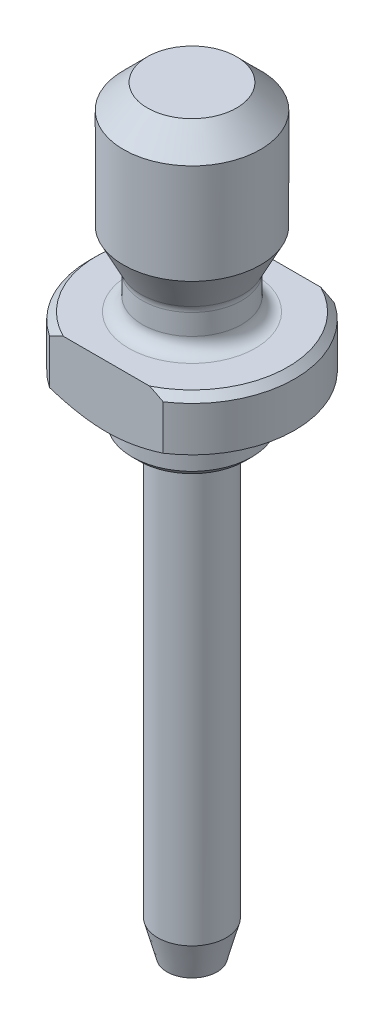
ISO-10303-21;
HEADER;
FILE_DESCRIPTION(('STEP AP214'),'2;1');
FILE_NAME('part.step','',(''),(''),'','','');
FILE_SCHEMA(('AUTOMOTIVE_DESIGN { 1 0 10303 214 1 1 1 1 }'));
ENDSEC;
DATA;
#1=APPLICATION_CONTEXT('core data for automotive mechanical design processes');
#2=APPLICATION_PROTOCOL_DEFINITION('international standard','automotive_design',2000,#1);
#3=PRODUCT_CONTEXT('',#1,'mechanical');
#4=PRODUCT('Part','Part','',(#3));
#5=PRODUCT_RELATED_PRODUCT_CATEGORY('part','',(#4));
#6=PRODUCT_DEFINITION_FORMATION('','',#4);
#7=PRODUCT_DEFINITION_CONTEXT('part definition',#1,'design');
#8=PRODUCT_DEFINITION('design','',#6,#7);
#9=PRODUCT_DEFINITION_SHAPE('','',#8);
#10=(LENGTH_UNIT() NAMED_UNIT(*) SI_UNIT(.MILLI.,.METRE.));
#11=(NAMED_UNIT(*) PLANE_ANGLE_UNIT() SI_UNIT($,.RADIAN.));
#12=(NAMED_UNIT(*) SI_UNIT($,.STERADIAN.) SOLID_ANGLE_UNIT());
#13=UNCERTAINTY_MEASURE_WITH_UNIT(LENGTH_MEASURE(1.E-05),#10,'distance_accuracy_value','');
#14=(GEOMETRIC_REPRESENTATION_CONTEXT(3) GLOBAL_UNCERTAINTY_ASSIGNED_CONTEXT((#13)) GLOBAL_UNIT_ASSIGNED_CONTEXT((#10,
#11,#12)) REPRESENTATION_CONTEXT('',''));
#15=CARTESIAN_POINT('',(0.,0.,0.));
#16=DIRECTION('',(0.,0.,1.));
#17=DIRECTION('',(1.,0.,0.));
#18=AXIS2_PLACEMENT_3D('',#15,#16,#17);
#19=CARTESIAN_POINT('',(0.,0.,0.));
#20=DIRECTION('',(0.,-1.,0.));
#21=DIRECTION('',(0.,0.,-1.));
#22=AXIS2_PLACEMENT_3D('',#19,#20,#21);
#23=CYLINDRICAL_SURFACE('',#22,3.);
#24=DIRECTION('',(0.,-1.,0.));
#25=VECTOR('',#24,1.);
#26=CARTESIAN_POINT('',(-1.6583123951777,0.,-2.5));
#27=LINE('',#26,#25);
#28=CARTESIAN_POINT('',(-1.6583123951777,-1.5,-2.5));
#29=VERTEX_POINT('',#28);
#30=CARTESIAN_POINT('',(-1.6583123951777,-0.2,-2.5));
#31=VERTEX_POINT('',#30);
#32=EDGE_CURVE('E195',#29,#31,#27,.F.);
#33=ORIENTED_EDGE('',*,*,#32,.F.);
#34=CARTESIAN_POINT('',(0.,-1.5,0.));
#35=DIRECTION('',(0.,1.,0.));
#36=DIRECTION('',(0.,0.,1.));
#37=AXIS2_PLACEMENT_3D('',#34,#35,#36);
#38=CIRCLE('',#37,3.);
#39=CARTESIAN_POINT('',(-1.6583123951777,-1.5,2.5));
#40=VERTEX_POINT('',#39);
#41=EDGE_CURVE('E289',#29,#40,#38,.T.);
#42=ORIENTED_EDGE('',*,*,#41,.T.);
#43=DIRECTION('',(0.,-1.,0.));
#44=VECTOR('',#43,1.);
#45=CARTESIAN_POINT('',(-1.6583123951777,0.,2.5));
#46=LINE('',#45,#44);
#47=CARTESIAN_POINT('',(-1.6583123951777,-0.2,2.5));
#48=VERTEX_POINT('',#47);
#49=EDGE_CURVE('E33',#48,#40,#46,.T.);
#50=ORIENTED_EDGE('',*,*,#49,.F.);
#51=CARTESIAN_POINT('',(0.,-0.2,0.));
#52=DIRECTION('',(0.,1.,0.));
#53=DIRECTION('',(0.,0.,1.));
#54=AXIS2_PLACEMENT_3D('',#51,#52,#53);
#55=CIRCLE('',#54,3.);
#56=EDGE_CURVE('E202',#48,#31,#55,.F.);
#57=ORIENTED_EDGE('',*,*,#56,.T.);
#58=EDGE_LOOP('',(#33,#42,#50,#57));
#59=FACE_BOUND('',#58,.T.);
#60=ADVANCED_FACE('F16',(#59),#23,.T.);
#61=CARTESIAN_POINT('',(0.,-0.2,0.));
#62=DIRECTION('',(0.,-1.,0.));
#63=DIRECTION('',(0.,0.,-1.));
#64=AXIS2_PLACEMENT_3D('',#61,#62,#63);
#65=CONICAL_SURFACE('',#64,3.,0.78539816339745);
#66=CARTESIAN_POINT('',(-1.65957840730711,-0.2007,-2.5));
#67=CARTESIAN_POINT('',(-1.57064275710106,-0.151563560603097,-2.5));
#68=CARTESIAN_POINT('',(-1.48050850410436,-0.104409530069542,-2.5));
#69=CARTESIAN_POINT('',(-1.29723653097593,-0.0153690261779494,-2.5));
#70=CARTESIAN_POINT('',(-1.20408808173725,0.026495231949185,-2.5));
#71=CARTESIAN_POINT('',(-1.01401910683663,0.103587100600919,-2.5));
#72=CARTESIAN_POINT('',(-0.917071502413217,0.138749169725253,-2.5));
#73=CARTESIAN_POINT('',(-0.720432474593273,0.199937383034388,-2.5));
#74=CARTESIAN_POINT('',(-0.62074566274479,0.22597797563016,-2.5));
#75=CARTESIAN_POINT('',(-0.446356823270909,0.261488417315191,-2.5));
#76=CARTESIAN_POINT('',(-0.372179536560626,0.273534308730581,-2.5));
#77=CARTESIAN_POINT('',(-0.223041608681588,0.291161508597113,-2.5));
#78=CARTESIAN_POINT('',(-0.148080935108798,0.296742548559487,-2.5));
#79=CARTESIAN_POINT('',(0.00156995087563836,0.301111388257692,-2.5));
#80=CARTESIAN_POINT('',(0.0762589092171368,0.299941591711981,-2.5));
#81=CARTESIAN_POINT('',(0.225233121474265,0.290976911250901,-2.5));
#82=CARTESIAN_POINT('',(0.299518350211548,0.283181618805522,-2.5));
#83=CARTESIAN_POINT('',(0.46561705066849,0.258646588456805,-2.5));
#84=CARTESIAN_POINT('',(0.55717231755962,0.240158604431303,-2.5));
#85=CARTESIAN_POINT('',(0.738174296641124,0.194773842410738,-2.5));
#86=CARTESIAN_POINT('',(0.827619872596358,0.167872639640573,-2.5));
#87=CARTESIAN_POINT('',(1.0045589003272,0.107009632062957,-2.5));
#88=CARTESIAN_POINT('',(1.0920397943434,0.0730118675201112,-2.5));
#89=CARTESIAN_POINT('',(1.26457685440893,-0.000546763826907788,-2.5));
#90=CARTESIAN_POINT('',(1.34963367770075,-0.0401061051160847,-2.5));
#91=CARTESIAN_POINT('',(1.47177892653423,-0.100868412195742,-2.5));
#92=CARTESIAN_POINT('',(1.50974987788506,-0.120327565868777,-2.5));
#93=CARTESIAN_POINT('',(1.58507226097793,-0.159972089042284,-2.5));
#94=CARTESIAN_POINT('',(1.62242582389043,-0.180153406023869,-2.5));
#95=CARTESIAN_POINT('',(1.65957840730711,-0.200699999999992,-2.5));
#96=B_SPLINE_CURVE_WITH_KNOTS('',3,(#66,#67,#68,#69,#70,#71,#72,#73,#74,#75,#76,#77,#78,#79,#80,
#81,#82,#83,#84,#85,#86,#87,#88,#89,#90,#91,#92,#93,#94,#95),.UNSPECIFIED.,.F.,.F.,(4,2,2,2,2,2,
2,2,2,2,2,2,2,2,4),(0.,0.304931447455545,0.611103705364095,0.920131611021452,1.22866777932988,
1.45386214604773,1.67906586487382,1.9028565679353,2.12666107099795,2.40638746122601,
2.68626121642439,2.96758916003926,3.24884008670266,3.37683284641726,3.50419469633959),.UNSPECIFIED.);
#97=CARTESIAN_POINT('',(-1.26095202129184,0.,-2.5));
#98=VERTEX_POINT('',#97);
#99=EDGE_CURVE('E293',#31,#98,#96,.T.);
#100=ORIENTED_EDGE('',*,*,#99,.F.);
#101=ORIENTED_EDGE('',*,*,#56,.F.);
#102=CARTESIAN_POINT('',(1.65957840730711,-0.2007,2.5));
#103=CARTESIAN_POINT('',(1.57064275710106,-0.151563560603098,2.5));
#104=CARTESIAN_POINT('',(1.48050850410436,-0.104409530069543,2.5));
#105=CARTESIAN_POINT('',(1.29723653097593,-0.0153690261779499,2.5));
#106=CARTESIAN_POINT('',(1.20408808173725,0.0264952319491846,2.5));
#107=CARTESIAN_POINT('',(1.01401910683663,0.103587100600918,2.5));
#108=CARTESIAN_POINT('',(0.917071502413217,0.138749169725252,2.5));
#109=CARTESIAN_POINT('',(0.720432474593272,0.199937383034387,2.5));
#110=CARTESIAN_POINT('',(0.62074566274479,0.225977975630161,2.5));
#111=CARTESIAN_POINT('',(0.446356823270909,0.261488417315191,2.5));
#112=CARTESIAN_POINT('',(0.372179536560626,0.27353430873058,2.5));
#113=CARTESIAN_POINT('',(0.223041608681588,0.291161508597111,2.5));
#114=CARTESIAN_POINT('',(0.148080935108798,0.296742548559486,2.5));
#115=CARTESIAN_POINT('',(-0.00156995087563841,0.301111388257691,2.5));
#116=CARTESIAN_POINT('',(-0.0762589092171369,0.29994159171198,2.5));
#117=CARTESIAN_POINT('',(-0.225233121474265,0.2909769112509,2.5));
#118=CARTESIAN_POINT('',(-0.299518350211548,0.283181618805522,2.5));
#119=CARTESIAN_POINT('',(-0.46561705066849,0.258646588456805,2.5));
#120=CARTESIAN_POINT('',(-0.55717231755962,0.240158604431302,2.5));
#121=CARTESIAN_POINT('',(-0.738174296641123,0.194773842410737,2.5));
#122=CARTESIAN_POINT('',(-0.827619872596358,0.167872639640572,2.5));
#123=CARTESIAN_POINT('',(-1.0045589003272,0.107009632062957,2.5));
#124=CARTESIAN_POINT('',(-1.0920397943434,0.0730118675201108,2.5));
#125=CARTESIAN_POINT('',(-1.26457685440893,-0.000546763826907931,2.5));
#126=CARTESIAN_POINT('',(-1.34963367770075,-0.0401061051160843,2.5));
#127=CARTESIAN_POINT('',(-1.47177892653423,-0.100868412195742,2.5));
#128=CARTESIAN_POINT('',(-1.50974987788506,-0.120327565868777,2.5));
#129=CARTESIAN_POINT('',(-1.58507226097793,-0.159972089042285,2.5));
#130=CARTESIAN_POINT('',(-1.62242582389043,-0.18015340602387,2.5));
#131=CARTESIAN_POINT('',(-1.65957840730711,-0.200699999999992,2.5));
#132=B_SPLINE_CURVE_WITH_KNOTS('',3,(#102,#103,#104,#105,#106,#107,#108,#109,#110,#111,#112,
#113,#114,#115,#116,#117,#118,#119,#120,#121,#122,#123,#124,#125,#126,#127,#128,#129,#130,#131),
.UNSPECIFIED.,.F.,.F.,(4,2,2,2,2,2,2,2,2,2,2,2,2,2,4),(0.,0.304931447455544,0.611103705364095,
0.920131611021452,1.22866777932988,1.45386214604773,1.67906586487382,1.9028565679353,
2.12666107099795,2.40638746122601,2.68626121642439,2.96758916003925,3.24884008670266,
3.37683284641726,3.50419469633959),.UNSPECIFIED.);
#133=CARTESIAN_POINT('',(-1.26095202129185,0.,2.5));
#134=VERTEX_POINT('',#133);
#135=EDGE_CURVE('E104',#134,#48,#132,.T.);
#136=ORIENTED_EDGE('',*,*,#135,.F.);
#137=CARTESIAN_POINT('',(0.,0.,0.));
#138=DIRECTION('',(0.,1.,0.));
#139=DIRECTION('',(0.,0.,1.));
#140=AXIS2_PLACEMENT_3D('',#137,#138,#139);
#141=CIRCLE('',#140,2.8);
#142=EDGE_CURVE('E206',#98,#134,#141,.T.);
#143=ORIENTED_EDGE('',*,*,#142,.F.);
#144=EDGE_LOOP('',(#100,#101,#136,#143));
#145=FACE_BOUND('',#144,.T.);
#146=ADVANCED_FACE('F169',(#145),#65,.T.);
#147=DIRECTION('',(0.,-1.,0.));
#148=VECTOR('',#147,1.);
#149=CARTESIAN_POINT('',(1.6583123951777,0.,-2.5));
#150=LINE('',#149,#148);
#151=CARTESIAN_POINT('',(1.6583123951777,-0.2,-2.5));
#152=VERTEX_POINT('',#151);
#153=CARTESIAN_POINT('',(1.6583123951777,-1.5,-2.5));
#154=VERTEX_POINT('',#153);
#155=EDGE_CURVE('E41',#152,#154,#150,.T.);
#156=ORIENTED_EDGE('',*,*,#155,.F.);
#157=CARTESIAN_POINT('',(1.6583123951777,-0.2,2.5));
#158=VERTEX_POINT('',#157);
#159=EDGE_CURVE('E192',#152,#158,#55,.F.);
#160=ORIENTED_EDGE('',*,*,#159,.T.);
#161=DIRECTION('',(0.,-1.,0.));
#162=VECTOR('',#161,1.);
#163=CARTESIAN_POINT('',(1.6583123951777,0.,2.5));
#164=LINE('',#163,#162);
#165=CARTESIAN_POINT('',(1.6583123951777,-1.5,2.5));
#166=VERTEX_POINT('',#165);
#167=EDGE_CURVE('E102',#166,#158,#164,.F.);
#168=ORIENTED_EDGE('',*,*,#167,.F.);
#169=EDGE_CURVE('E194',#166,#154,#38,.T.);
#170=ORIENTED_EDGE('',*,*,#169,.T.);
#171=EDGE_LOOP('',(#156,#160,#168,#170));
#172=FACE_BOUND('',#171,.T.);
#173=ADVANCED_FACE('F172',(#172),#23,.T.);
#174=CARTESIAN_POINT('',(0.,0.,0.));
#175=DIRECTION('',(0.,1.,0.));
#176=DIRECTION('',(0.,0.,1.));
#177=AXIS2_PLACEMENT_3D('',#174,#175,#176);
#178=PLANE('',#177);
#179=DIRECTION('',(1.,0.,0.));
#180=VECTOR('',#179,1.);
#181=CARTESIAN_POINT('',(-5.,0.,-2.5));
#182=LINE('',#181,#180);
#183=CARTESIAN_POINT('',(1.26095202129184,0.,-2.5));
#184=VERTEX_POINT('',#183);
#185=EDGE_CURVE('E97',#98,#184,#182,.T.);
#186=ORIENTED_EDGE('',*,*,#185,.F.);
#187=ORIENTED_EDGE('',*,*,#142,.T.);
#188=DIRECTION('',(1.,0.,0.));
#189=VECTOR('',#188,1.);
#190=CARTESIAN_POINT('',(-5.,0.,2.5));
#191=LINE('',#190,#189);
#192=CARTESIAN_POINT('',(1.26095202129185,0.,2.5));
#193=VERTEX_POINT('',#192);
#194=EDGE_CURVE('E96',#134,#193,#191,.T.);
#195=ORIENTED_EDGE('',*,*,#194,.T.);
#196=EDGE_CURVE('E212',#193,#184,#141,.T.);
#197=ORIENTED_EDGE('',*,*,#196,.T.);
#198=EDGE_LOOP('',(#186,#187,#195,#197));
#199=FACE_BOUND('',#198,.T.);
#200=CARTESIAN_POINT('',(0.,0.,0.));
#201=DIRECTION('',(0.,1.,0.));
#202=DIRECTION('',(0.,0.,1.));
#203=AXIS2_PLACEMENT_3D('',#200,#201,#202);
#204=CIRCLE('',#203,1.85);
#205=CARTESIAN_POINT('',(0.,0.,1.85));
#206=VERTEX_POINT('',#205);
#207=EDGE_CURVE('E140',#206,#206,#204,.F.);
#208=ORIENTED_EDGE('',*,*,#207,.T.);
#209=EDGE_LOOP('',(#208));
#210=FACE_BOUND('',#209,.T.);
#211=ADVANCED_FACE('F181',(#199,#210),#178,.T.);
#212=EDGE_CURVE('E200',#184,#152,#96,.T.);
#213=ORIENTED_EDGE('',*,*,#212,.F.);
#214=ORIENTED_EDGE('',*,*,#196,.F.);
#215=EDGE_CURVE('E112',#158,#193,#132,.T.);
#216=ORIENTED_EDGE('',*,*,#215,.F.);
#217=ORIENTED_EDGE('',*,*,#159,.F.);
#218=EDGE_LOOP('',(#213,#214,#216,#217));
#219=FACE_BOUND('',#218,.T.);
#220=ADVANCED_FACE('F115',(#219),#65,.T.);
#221=CARTESIAN_POINT('',(0.,2.17943577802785,0.));
#222=DIRECTION('',(0.,1.,0.));
#223=DIRECTION('',(0.,0.,1.));
#224=AXIS2_PLACEMENT_3D('',#221,#222,#223);
#225=CONICAL_SURFACE('',#224,2.,0.471238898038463);
#226=CARTESIAN_POINT('',(0.,1.18556469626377,0.));
#227=DIRECTION('',(0.,1.,0.));
#228=DIRECTION('',(0.,0.,1.));
#229=AXIS2_PLACEMENT_3D('',#226,#227,#228);
#230=CIRCLE('',#229,1.49359739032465);
#231=CARTESIAN_POINT('',(0.,1.18556469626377,1.49359739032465));
#232=VERTEX_POINT('',#231);
#233=EDGE_CURVE('E225',#232,#232,#230,.T.);
#234=ORIENTED_EDGE('',*,*,#233,.T.);
#235=EDGE_LOOP('',(#234));
#236=FACE_BOUND('',#235,.T.);
#237=CARTESIAN_POINT('',(0.,2.17943577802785,0.));
#238=DIRECTION('',(0.,-1.,0.));
#239=DIRECTION('',(0.,0.,-1.));
#240=AXIS2_PLACEMENT_3D('',#237,#238,#239);
#241=CIRCLE('',#240,2.);
#242=CARTESIAN_POINT('',(0.,2.17943577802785,-2.));
#243=VERTEX_POINT('',#242);
#244=EDGE_CURVE('E203',#243,#243,#241,.T.);
#245=ORIENTED_EDGE('',*,*,#244,.T.);
#246=EDGE_LOOP('',(#245));
#247=FACE_BOUND('',#246,.T.);
#248=ADVANCED_FACE('F268',(#236,#247),#225,.T.);
#249=CARTESIAN_POINT('',(0.,0.,0.));
#250=DIRECTION('',(0.,-1.,0.));
#251=DIRECTION('',(0.,0.,-1.));
#252=AXIS2_PLACEMENT_3D('',#249,#250,#251);
#253=CYLINDRICAL_SURFACE('',#252,1.45);
#254=CARTESIAN_POINT('',(0.,1.00396849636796,0.));
#255=DIRECTION('',(0.,-1.,0.));
#256=DIRECTION('',(0.,0.,-1.));
#257=AXIS2_PLACEMENT_3D('',#254,#255,#256);
#258=CIRCLE('',#257,1.45);
#259=CARTESIAN_POINT('',(0.,1.00396849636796,-1.45));
#260=VERTEX_POINT('',#259);
#261=EDGE_CURVE('E223',#260,#260,#258,.T.);
#262=ORIENTED_EDGE('',*,*,#261,.T.);
#263=EDGE_LOOP('',(#262));
#264=FACE_BOUND('',#263,.T.);
#265=CARTESIAN_POINT('',(0.,0.4,0.));
#266=DIRECTION('',(0.,1.,0.));
#267=DIRECTION('',(0.,0.,1.));
#268=AXIS2_PLACEMENT_3D('',#265,#266,#267);
#269=CIRCLE('',#268,1.45);
#270=CARTESIAN_POINT('',(0.,0.4,1.45));
#271=VERTEX_POINT('',#270);
#272=EDGE_CURVE('E220',#271,#271,#269,.T.);
#273=ORIENTED_EDGE('',*,*,#272,.T.);
#274=EDGE_LOOP('',(#273));
#275=FACE_BOUND('',#274,.T.);
#276=ADVANCED_FACE('F257',(#264,#275),#253,.T.);
#277=CARTESIAN_POINT('',(0.,5.8,0.));
#278=DIRECTION('',(0.,1.,0.));
#279=DIRECTION('',(0.,0.,1.));
#280=AXIS2_PLACEMENT_3D('',#277,#278,#279);
#281=PLANE('',#280);
#282=CARTESIAN_POINT('',(0.,5.8,0.));
#283=DIRECTION('',(0.,1.,0.));
#284=DIRECTION('',(0.,0.,1.));
#285=AXIS2_PLACEMENT_3D('',#282,#283,#284);
#286=CIRCLE('',#285,1.3);
#287=CARTESIAN_POINT('',(0.,5.8,1.3));
#288=VERTEX_POINT('',#287);
#289=EDGE_CURVE('E217',#288,#288,#286,.T.);
#290=ORIENTED_EDGE('',*,*,#289,.T.);
#291=EDGE_LOOP('',(#290));
#292=FACE_BOUND('',#291,.T.);
#293=ADVANCED_FACE('F248',(#292),#281,.T.);
#294=CARTESIAN_POINT('',(0.,5.1,0.));
#295=DIRECTION('',(0.,-1.,0.));
#296=DIRECTION('',(0.,0.,-1.));
#297=AXIS2_PLACEMENT_3D('',#294,#295,#296);
#298=CONICAL_SURFACE('',#297,2.,0.78539816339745);
#299=ORIENTED_EDGE('',*,*,#289,.F.);
#300=EDGE_LOOP('',(#299));
#301=FACE_BOUND('',#300,.T.);
#302=CARTESIAN_POINT('',(0.,5.1,0.));
#303=DIRECTION('',(0.,1.,0.));
#304=DIRECTION('',(0.,0.,1.));
#305=AXIS2_PLACEMENT_3D('',#302,#303,#304);
#306=CIRCLE('',#305,2.);
#307=CARTESIAN_POINT('',(0.,5.1,2.));
#308=VERTEX_POINT('',#307);
#309=EDGE_CURVE('E214',#308,#308,#306,.F.);
#310=ORIENTED_EDGE('',*,*,#309,.F.);
#311=EDGE_LOOP('',(#310));
#312=FACE_BOUND('',#311,.T.);
#313=ADVANCED_FACE('F246',(#301,#312),#298,.T.);
#314=CARTESIAN_POINT('',(0.,0.,0.));
#315=DIRECTION('',(0.,-1.,0.));
#316=DIRECTION('',(0.,0.,-1.));
#317=AXIS2_PLACEMENT_3D('',#314,#315,#316);
#318=CYLINDRICAL_SURFACE('',#317,2.);
#319=ORIENTED_EDGE('',*,*,#244,.F.);
#320=EDGE_LOOP('',(#319));
#321=FACE_BOUND('',#320,.T.);
#322=ORIENTED_EDGE('',*,*,#309,.T.);
#323=EDGE_LOOP('',(#322));
#324=FACE_BOUND('',#323,.T.);
#325=ADVANCED_FACE('F242',(#321,#324),#318,.T.);
#326=CARTESIAN_POINT('',(0.,1.00396849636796,0.));
#327=DIRECTION('',(0.,-1.,0.));
#328=DIRECTION('',(0.,0.,-1.));
#329=AXIS2_PLACEMENT_3D('',#326,#327,#328);
#330=TOROIDAL_SURFACE('',#329,1.85,0.4);
#331=ORIENTED_EDGE('',*,*,#233,.F.);
#332=EDGE_LOOP('',(#331));
#333=FACE_BOUND('',#332,.T.);
#334=ORIENTED_EDGE('',*,*,#261,.F.);
#335=EDGE_LOOP('',(#334));
#336=FACE_BOUND('',#335,.T.);
#337=ADVANCED_FACE('F235',(#333,#336),#330,.F.);
#338=CARTESIAN_POINT('',(0.,0.4,0.));
#339=DIRECTION('',(0.,1.,0.));
#340=DIRECTION('',(0.,0.,1.));
#341=AXIS2_PLACEMENT_3D('',#338,#339,#340);
#342=TOROIDAL_SURFACE('',#341,1.85,0.4);
#343=ORIENTED_EDGE('',*,*,#272,.F.);
#344=EDGE_LOOP('',(#343));
#345=FACE_BOUND('',#344,.T.);
#346=ORIENTED_EDGE('',*,*,#207,.F.);
#347=EDGE_LOOP('',(#346));
#348=FACE_BOUND('',#347,.T.);
#349=ADVANCED_FACE('F233',(#345,#348),#342,.F.);
#350=CARTESIAN_POINT('',(0.,0.,0.));
#351=DIRECTION('',(0.,1.,0.));
#352=DIRECTION('',(0.,0.,1.));
#353=AXIS2_PLACEMENT_3D('',#350,#351,#352);
#354=CYLINDRICAL_SURFACE('',#353,1.75);
#355=CARTESIAN_POINT('',(0.,-2.8,0.));
#356=DIRECTION('',(0.,-1.,0.));
#357=DIRECTION('',(0.,0.,-1.));
#358=AXIS2_PLACEMENT_3D('',#355,#356,#357);
#359=CIRCLE('',#358,1.75);
#360=CARTESIAN_POINT('',(0.,-2.8,-1.75));
#361=VERTEX_POINT('',#360);
#362=EDGE_CURVE('E26',#361,#361,#359,.F.);
#363=ORIENTED_EDGE('',*,*,#362,.T.);
#364=EDGE_LOOP('',(#363));
#365=FACE_BOUND('',#364,.T.);
#366=CARTESIAN_POINT('',(0.,-2.22168783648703,0.));
#367=DIRECTION('',(0.,1.,0.));
#368=DIRECTION('',(0.,0.,1.));
#369=AXIS2_PLACEMENT_3D('',#366,#367,#368);
#370=CIRCLE('',#369,1.75);
#371=CARTESIAN_POINT('',(0.,-2.22168783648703,1.75));
#372=VERTEX_POINT('',#371);
#373=EDGE_CURVE('E208',#372,#372,#370,.T.);
#374=ORIENTED_EDGE('',*,*,#373,.F.);
#375=EDGE_LOOP('',(#374));
#376=FACE_BOUND('',#375,.T.);
#377=ADVANCED_FACE('F149',(#365,#376),#354,.T.);
#378=CARTESIAN_POINT('',(0.,-1.5,0.));
#379=DIRECTION('',(0.,1.,0.));
#380=DIRECTION('',(0.,0.,1.));
#381=AXIS2_PLACEMENT_3D('',#378,#379,#380);
#382=CONICAL_SURFACE('',#381,3.,1.0471975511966);
#383=CARTESIAN_POINT('',(9.04344691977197,2.18501888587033,-2.5));
#384=CARTESIAN_POINT('',(8.84486915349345,2.07452046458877,-2.5));
#385=CARTESIAN_POINT('',(8.6461860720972,1.96421069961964,-2.5));
#386=CARTESIAN_POINT('',(8.24855199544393,1.74407144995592,-2.5));
#387=CARTESIAN_POINT('',(8.0496009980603,1.63424196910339,-2.5));
#388=CARTESIAN_POINT('',(7.65130763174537,1.41512987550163,-2.5));
#389=CARTESIAN_POINT('',(7.45196515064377,1.30584746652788,-2.5));
#390=CARTESIAN_POINT('',(7.05288122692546,1.08801472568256,-2.5));
#391=CARTESIAN_POINT('',(6.85313978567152,0.979464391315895,-2.5));
#392=CARTESIAN_POINT('',(6.45191735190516,0.76262160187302,-2.5));
#393=CARTESIAN_POINT('',(6.2504332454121,0.654334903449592,-2.5));
#394=CARTESIAN_POINT('',(5.84681702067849,0.438976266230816,-2.5));
#395=CARTESIAN_POINT('',(5.644684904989,0.331904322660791,-2.5));
#396=CARTESIAN_POINT('',(5.23960939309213,0.119384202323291,-2.5));
#397=CARTESIAN_POINT('',(5.03666613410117,0.0139357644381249,-2.5));
#398=CARTESIAN_POINT('',(4.6296632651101,-0.194781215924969,-2.5));
#399=CARTESIAN_POINT('',(4.42560367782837,-0.29804980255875,-2.5));
#400=CARTESIAN_POINT('',(4.01543321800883,-0.501804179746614,-2.5));
#401=CARTESIAN_POINT('',(3.80931838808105,-0.602282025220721,-2.5));
#402=CARTESIAN_POINT('',(3.39492948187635,-0.798843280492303,-2.5));
#403=CARTESIAN_POINT('',(3.18665497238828,-0.894925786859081,-2.5));
#404=CARTESIAN_POINT('',(2.87181918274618,-1.03410994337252,-2.5));
#405=CARTESIAN_POINT('',(2.76636934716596,-1.07972206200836,-2.5));
#406=CARTESIAN_POINT('',(2.55458233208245,-1.16883187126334,-2.5));
#407=CARTESIAN_POINT('',(2.44824519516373,-1.21232966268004,-2.5));
#408=CARTESIAN_POINT('',(2.23453823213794,-1.29667142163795,-2.5));
#409=CARTESIAN_POINT('',(2.12716858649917,-1.33751584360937,-2.5));
#410=CARTESIAN_POINT('',(1.91122049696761,-1.41585419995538,-2.5));
#411=CARTESIAN_POINT('',(1.80264216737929,-1.45334844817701,-2.5));
#412=CARTESIAN_POINT('',(1.55243589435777,-1.53436354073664,-2.5));
#413=CARTESIAN_POINT('',(1.4103452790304,-1.57648394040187,-2.5));
#414=CARTESIAN_POINT('',(1.12367930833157,-1.65129874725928,-2.5));
#415=CARTESIAN_POINT('',(0.979104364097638,-1.68399469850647,-2.5));
#416=CARTESIAN_POINT('',(0.689079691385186,-1.73692687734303,-2.5));
#417=CARTESIAN_POINT('',(0.543652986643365,-1.75728386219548,-2.5));
#418=CARTESIAN_POINT('',(0.32458859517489,-1.77715913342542,-2.5));
#419=CARTESIAN_POINT('',(0.25141543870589,-1.78200753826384,-2.5));
#420=CARTESIAN_POINT('',(0.104908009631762,-1.7880216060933,-2.5));
#421=CARTESIAN_POINT('',(0.0315737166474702,-1.78918677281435,-2.5));
#422=CARTESIAN_POINT('',(-0.188250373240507,-1.78704951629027,-2.5));
#423=CARTESIAN_POINT('',(-0.334718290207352,-1.77812887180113,-2.5));
#424=CARTESIAN_POINT('',(-0.626144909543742,-1.74640032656,-2.5));
#425=CARTESIAN_POINT('',(-0.771102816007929,-1.72358544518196,-2.5));
#426=CARTESIAN_POINT('',(-0.988370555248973,-1.68048220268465,-2.5));
#427=CARTESIAN_POINT('',(-1.06155788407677,-1.66440957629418,-2.5));
#428=CARTESIAN_POINT('',(-1.20727885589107,-1.62964366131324,-2.5));
#429=CARTESIAN_POINT('',(-1.27981274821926,-1.61095142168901,-2.5));
#430=CARTESIAN_POINT('',(-1.42426253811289,-1.57127963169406,-2.5));
#431=CARTESIAN_POINT('',(-1.4961783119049,-1.55029963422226,-2.5));
#432=CARTESIAN_POINT('',(-1.63940460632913,-1.50636500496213,-2.5));
#433=CARTESIAN_POINT('',(-1.71071509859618,-1.48341028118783,-2.5));
#434=CARTESIAN_POINT('',(-1.9546492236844,-1.40168202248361,-2.5));
#435=CARTESIAN_POINT('',(-2.12588350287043,-1.33875688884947,-2.5));
#436=CARTESIAN_POINT('',(-2.46569215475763,-1.20605197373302,-2.5));
#437=CARTESIAN_POINT('',(-2.63426546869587,-1.13626953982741,-2.5));
#438=CARTESIAN_POINT('',(-2.96953891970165,-0.991834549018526,-2.5));
#439=CARTESIAN_POINT('',(-3.1362365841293,-0.917176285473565,-2.5));
#440=CARTESIAN_POINT('',(-3.46802139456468,-0.764449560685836,-2.5));
#441=CARTESIAN_POINT('',(-3.63310877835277,-0.686381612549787,-2.5));
#442=CARTESIAN_POINT('',(-3.96278401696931,-0.527399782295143,-2.5));
#443=CARTESIAN_POINT('',(-4.12736662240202,-0.446475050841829,-2.5));
#444=CARTESIAN_POINT('',(-4.45558955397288,-0.282729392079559,-2.5));
#445=CARTESIAN_POINT('',(-4.61922985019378,-0.199908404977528,-2.5));
#446=CARTESIAN_POINT('',(-5.1088248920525,0.0505814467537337,-2.5));
#447=CARTESIAN_POINT('',(-5.43368372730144,0.220389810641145,-2.5));
#448=CARTESIAN_POINT('',(-6.03434388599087,0.538509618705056,-2.5));
#449=CARTESIAN_POINT('',(-6.31039708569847,0.686348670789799,-2.5));
#450=CARTESIAN_POINT('',(-6.86158364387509,0.983861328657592,-2.5));
#451=CARTESIAN_POINT('',(-7.13671680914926,1.13353529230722,-2.5));
#452=CARTESIAN_POINT('',(-7.6841077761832,1.432993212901,-2.5));
#453=CARTESIAN_POINT('',(-7.95637114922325,1.58276700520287,-2.5));
#454=CARTESIAN_POINT('',(-8.50030126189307,1.8832550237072,-2.5));
#455=CARTESIAN_POINT('',(-8.77196811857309,2.03396903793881,-2.5));
#456=CARTESIAN_POINT('',(-9.04344691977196,2.18501888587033,-2.5));
#457=B_SPLINE_CURVE_WITH_KNOTS('',3,(#383,#384,#385,#386,#387,#388,#389,#390,#391,#392,#393,
#394,#395,#396,#397,#398,#399,#400,#401,#402,#403,#404,#405,#406,#407,#408,#409,#410,#411,#412,
#413,#414,#415,#416,#417,#418,#419,#420,#421,#422,#423,#424,#425,#426,#427,#428,#429,#430,#431,
#432,#433,#434,#435,#436,#437,#438,#439,#440,#441,#442,#443,#444,#445,#446,#447,#448,#449,#450,
#451,#452,#453,#454,#455,#456),.UNSPECIFIED.,.F.,.F.,(4,2,2,2,2,2,2,2,2,2,2,2,2,2,2,2,2,2,2,2,2,
2,2,2,2,2,2,2,2,2,2,2,2,2,2,2,4),(0.,0.681753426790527,1.36351229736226,2.04550860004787,
2.72750257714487,3.41371858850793,4.09993190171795,4.78603366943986,5.47212152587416,
6.15999563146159,6.84801049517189,7.1926684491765,7.53730995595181,7.88189228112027,
8.2264422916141,8.67079974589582,9.11508435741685,9.55494758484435,9.77486508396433,
9.99481221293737,10.4342360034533,10.8738807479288,11.0986350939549,11.3232996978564,
11.5480082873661,11.7727273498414,12.3197645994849,12.8670142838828,13.4149163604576,
13.9627362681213,14.5129257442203,15.063132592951,16.1627783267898,17.1022167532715,
18.0418414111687,18.9740603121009,19.9060761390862),.UNSPECIFIED.);
#458=EDGE_CURVE('E139',#154,#29,#457,.T.);
#459=ORIENTED_EDGE('',*,*,#458,.F.);
#460=ORIENTED_EDGE('',*,*,#169,.F.);
#461=CARTESIAN_POINT('',(-9.04344691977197,2.18501888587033,2.5));
#462=CARTESIAN_POINT('',(-8.84486915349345,2.07452046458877,2.5));
#463=CARTESIAN_POINT('',(-8.6461860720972,1.96421069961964,2.5));
#464=CARTESIAN_POINT('',(-8.24855199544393,1.74407144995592,2.5));
#465=CARTESIAN_POINT('',(-8.0496009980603,1.63424196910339,2.5));
#466=CARTESIAN_POINT('',(-7.65130763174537,1.41512987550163,2.5));
#467=CARTESIAN_POINT('',(-7.45196515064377,1.30584746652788,2.5));
#468=CARTESIAN_POINT('',(-7.05288122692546,1.08801472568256,2.5));
#469=CARTESIAN_POINT('',(-6.85313978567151,0.979464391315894,2.5));
#470=CARTESIAN_POINT('',(-6.45191735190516,0.762621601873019,2.5));
#471=CARTESIAN_POINT('',(-6.2504332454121,0.654334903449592,2.5));
#472=CARTESIAN_POINT('',(-5.84681702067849,0.438976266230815,2.5));
#473=CARTESIAN_POINT('',(-5.644684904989,0.331904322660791,2.5));
#474=CARTESIAN_POINT('',(-5.23960939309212,0.119384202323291,2.5));
#475=CARTESIAN_POINT('',(-5.03666613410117,0.0139357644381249,2.5));
#476=CARTESIAN_POINT('',(-4.6296632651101,-0.194781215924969,2.5));
#477=CARTESIAN_POINT('',(-4.42560367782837,-0.29804980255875,2.5));
#478=CARTESIAN_POINT('',(-4.01543321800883,-0.501804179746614,2.5));
#479=CARTESIAN_POINT('',(-3.80931838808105,-0.602282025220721,2.5));
#480=CARTESIAN_POINT('',(-3.39492948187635,-0.798843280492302,2.5));
#481=CARTESIAN_POINT('',(-3.18665497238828,-0.89492578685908,2.5));
#482=CARTESIAN_POINT('',(-2.87181918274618,-1.03410994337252,2.5));
#483=CARTESIAN_POINT('',(-2.76636934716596,-1.07972206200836,2.5));
#484=CARTESIAN_POINT('',(-2.55458233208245,-1.16883187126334,2.5));
#485=CARTESIAN_POINT('',(-2.44824519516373,-1.21232966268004,2.5));
#486=CARTESIAN_POINT('',(-2.23453823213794,-1.29667142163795,2.5));
#487=CARTESIAN_POINT('',(-2.12716858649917,-1.33751584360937,2.5));
#488=CARTESIAN_POINT('',(-1.91122049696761,-1.41585419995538,2.5));
#489=CARTESIAN_POINT('',(-1.80264216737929,-1.45334844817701,2.5));
#490=CARTESIAN_POINT('',(-1.55243589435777,-1.53436354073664,2.5));
#491=CARTESIAN_POINT('',(-1.4103452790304,-1.57648394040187,2.5));
#492=CARTESIAN_POINT('',(-1.12367930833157,-1.65129874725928,2.5));
#493=CARTESIAN_POINT('',(-0.979104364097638,-1.68399469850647,2.5));
#494=CARTESIAN_POINT('',(-0.689079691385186,-1.73692687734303,2.5));
#495=CARTESIAN_POINT('',(-0.543652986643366,-1.75728386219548,2.5));
#496=CARTESIAN_POINT('',(-0.324588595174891,-1.77715913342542,2.5));
#497=CARTESIAN_POINT('',(-0.251415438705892,-1.78200753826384,2.5));
#498=CARTESIAN_POINT('',(-0.104908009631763,-1.7880216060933,2.5));
#499=CARTESIAN_POINT('',(-0.0315737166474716,-1.78918677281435,2.5));
#500=CARTESIAN_POINT('',(0.188250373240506,-1.78704951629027,2.5));
#501=CARTESIAN_POINT('',(0.33471829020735,-1.77812887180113,2.5));
#502=CARTESIAN_POINT('',(0.626144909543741,-1.74640032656,2.5));
#503=CARTESIAN_POINT('',(0.771102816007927,-1.72358544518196,2.5));
#504=CARTESIAN_POINT('',(0.98837055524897,-1.68048220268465,2.5));
#505=CARTESIAN_POINT('',(1.06155788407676,-1.66440957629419,2.5));
#506=CARTESIAN_POINT('',(1.20727885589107,-1.62964366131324,2.5));
#507=CARTESIAN_POINT('',(1.27981274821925,-1.61095142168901,2.5));
#508=CARTESIAN_POINT('',(1.42426253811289,-1.57127963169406,2.5));
#509=CARTESIAN_POINT('',(1.4961783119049,-1.55029963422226,2.5));
#510=CARTESIAN_POINT('',(1.63940460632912,-1.50636500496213,2.5));
#511=CARTESIAN_POINT('',(1.71071509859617,-1.48341028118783,2.5));
#512=CARTESIAN_POINT('',(1.9546492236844,-1.40168202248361,2.5));
#513=CARTESIAN_POINT('',(2.12588350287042,-1.33875688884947,2.5));
#514=CARTESIAN_POINT('',(2.46569215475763,-1.20605197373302,2.5));
#515=CARTESIAN_POINT('',(2.63426546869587,-1.13626953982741,2.5));
#516=CARTESIAN_POINT('',(2.96953891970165,-0.991834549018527,2.5));
#517=CARTESIAN_POINT('',(3.1362365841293,-0.917176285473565,2.5));
#518=CARTESIAN_POINT('',(3.46802139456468,-0.764449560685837,2.5));
#519=CARTESIAN_POINT('',(3.63310877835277,-0.686381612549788,2.5));
#520=CARTESIAN_POINT('',(3.96278401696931,-0.527399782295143,2.5));
#521=CARTESIAN_POINT('',(4.12736662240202,-0.446475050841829,2.5));
#522=CARTESIAN_POINT('',(4.45558955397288,-0.282729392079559,2.5));
#523=CARTESIAN_POINT('',(4.61922985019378,-0.199908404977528,2.5));
#524=CARTESIAN_POINT('',(5.1088248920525,0.050581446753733,2.5));
#525=CARTESIAN_POINT('',(5.43368372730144,0.220389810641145,2.5));
#526=CARTESIAN_POINT('',(6.03434388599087,0.538509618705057,2.5));
#527=CARTESIAN_POINT('',(6.31039708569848,0.686348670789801,2.5));
#528=CARTESIAN_POINT('',(6.86158364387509,0.983861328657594,2.5));
#529=CARTESIAN_POINT('',(7.13671680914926,1.13353529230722,2.5));
#530=CARTESIAN_POINT('',(7.6841077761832,1.432993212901,2.5));
#531=CARTESIAN_POINT('',(7.95637114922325,1.58276700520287,2.5));
#532=CARTESIAN_POINT('',(8.50030126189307,1.8832550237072,2.5));
#533=CARTESIAN_POINT('',(8.7719681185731,2.03396903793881,2.5));
#534=CARTESIAN_POINT('',(9.04344691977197,2.18501888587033,2.5));
#535=B_SPLINE_CURVE_WITH_KNOTS('',3,(#461,#462,#463,#464,#465,#466,#467,#468,#469,#470,#471,
#472,#473,#474,#475,#476,#477,#478,#479,#480,#481,#482,#483,#484,#485,#486,#487,#488,#489,#490,
#491,#492,#493,#494,#495,#496,#497,#498,#499,#500,#501,#502,#503,#504,#505,#506,#507,#508,#509,
#510,#511,#512,#513,#514,#515,#516,#517,#518,#519,#520,#521,#522,#523,#524,#525,#526,#527,#528,
#529,#530,#531,#532,#533,#534),.UNSPECIFIED.,.F.,.F.,(4,2,2,2,2,2,2,2,2,2,2,2,2,2,2,2,2,2,2,2,2,
2,2,2,2,2,2,2,2,2,2,2,2,2,2,2,4),(0.,0.681753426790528,1.36351229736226,2.04550860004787,
2.72750257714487,3.41371858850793,4.09993190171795,4.78603366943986,5.47212152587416,
6.15999563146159,6.84801049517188,7.1926684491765,7.53730995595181,7.88189228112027,
8.2264422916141,8.67079974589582,9.11508435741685,9.55494758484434,9.77486508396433,
9.99481221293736,10.4342360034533,10.8738807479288,11.0986350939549,11.3232996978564,
11.5480082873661,11.7727273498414,12.3197645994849,12.8670142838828,13.4149163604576,
13.9627362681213,14.5129257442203,15.063132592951,16.1627783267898,17.1022167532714,
18.0418414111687,18.9740603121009,19.9060761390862),.UNSPECIFIED.);
#536=EDGE_CURVE('E132',#40,#166,#535,.T.);
#537=ORIENTED_EDGE('',*,*,#536,.F.);
#538=ORIENTED_EDGE('',*,*,#41,.F.);
#539=EDGE_LOOP('',(#459,#460,#537,#538));
#540=FACE_BOUND('',#539,.T.);
#541=ORIENTED_EDGE('',*,*,#373,.T.);
#542=EDGE_LOOP('',(#541));
#543=FACE_BOUND('',#542,.T.);
#544=ADVANCED_FACE('F127',(#540,#543),#382,.T.);
#545=CARTESIAN_POINT('',(3.,-3.,0.));
#546=DIRECTION('',(0.,-1.,0.));
#547=DIRECTION('',(0.,0.,-1.));
#548=AXIS2_PLACEMENT_3D('',#545,#546,#547);
#549=PLANE('',#548);
#550=CARTESIAN_POINT('',(0.,-3.,0.));
#551=DIRECTION('',(0.,-1.,0.));
#552=DIRECTION('',(0.,0.,-1.));
#553=AXIS2_PLACEMENT_3D('',#550,#551,#552);
#554=CIRCLE('',#553,1.55);
#555=CARTESIAN_POINT('',(0.,-3.,-1.55));
#556=VERTEX_POINT('',#555);
#557=EDGE_CURVE('E9',#556,#556,#554,.T.);
#558=ORIENTED_EDGE('',*,*,#557,.T.);
#559=EDGE_LOOP('',(#558));
#560=FACE_BOUND('',#559,.T.);
#561=CARTESIAN_POINT('',(0.,-3.,0.));
#562=DIRECTION('',(0.,-1.,0.));
#563=DIRECTION('',(0.,0.,-1.));
#564=AXIS2_PLACEMENT_3D('',#561,#562,#563);
#565=CIRCLE('',#564,1.2);
#566=CARTESIAN_POINT('',(0.,-3.,-1.2));
#567=VERTEX_POINT('',#566);
#568=EDGE_CURVE('E90',#567,#567,#565,.T.);
#569=ORIENTED_EDGE('',*,*,#568,.F.);
#570=EDGE_LOOP('',(#569));
#571=FACE_BOUND('',#570,.T.);
#572=ADVANCED_FACE('F125',(#560,#571),#549,.T.);
#573=CARTESIAN_POINT('',(-5.,-2.70202412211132,2.5));
#574=DIRECTION('',(0.,0.,-1.));
#575=DIRECTION('',(0.,1.,0.));
#576=AXIS2_PLACEMENT_3D('',#573,#574,#575);
#577=PLANE('',#576);
#578=ORIENTED_EDGE('',*,*,#215,.T.);
#579=ORIENTED_EDGE('',*,*,#194,.F.);
#580=ORIENTED_EDGE('',*,*,#135,.T.);
#581=ORIENTED_EDGE('',*,*,#49,.T.);
#582=ORIENTED_EDGE('',*,*,#536,.T.);
#583=ORIENTED_EDGE('',*,*,#167,.T.);
#584=EDGE_LOOP('',(#578,#579,#580,#581,#582,#583));
#585=FACE_BOUND('',#584,.T.);
#586=ADVANCED_FACE('F119',(#585),#577,.F.);
#587=CARTESIAN_POINT('',(-5.,-2.70202412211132,-2.5));
#588=DIRECTION('',(0.,0.,1.));
#589=DIRECTION('',(1.,0.,0.));
#590=AXIS2_PLACEMENT_3D('',#587,#588,#589);
#591=PLANE('',#590);
#592=ORIENTED_EDGE('',*,*,#99,.T.);
#593=ORIENTED_EDGE('',*,*,#185,.T.);
#594=ORIENTED_EDGE('',*,*,#212,.T.);
#595=ORIENTED_EDGE('',*,*,#155,.T.);
#596=ORIENTED_EDGE('',*,*,#458,.T.);
#597=ORIENTED_EDGE('',*,*,#32,.T.);
#598=EDGE_LOOP('',(#592,#593,#594,#595,#596,#597));
#599=FACE_BOUND('',#598,.T.);
#600=ADVANCED_FACE('F124',(#599),#591,.F.);
#601=CARTESIAN_POINT('',(0.,-3.,0.));
#602=DIRECTION('',(0.,-1.,0.));
#603=DIRECTION('',(0.,0.,-1.));
#604=AXIS2_PLACEMENT_3D('',#601,#602,#603);
#605=CONICAL_SURFACE('',#604,1.2,0.785398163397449);
#606=CARTESIAN_POINT('',(0.,-2.8,0.));
#607=DIRECTION('',(0.,-1.,0.));
#608=DIRECTION('',(0.,0.,-1.));
#609=AXIS2_PLACEMENT_3D('',#606,#607,#608);
#610=CIRCLE('',#609,1.);
#611=CARTESIAN_POINT('',(0.,-2.8,-1.));
#612=VERTEX_POINT('',#611);
#613=EDGE_CURVE('E93',#612,#612,#610,.T.);
#614=ORIENTED_EDGE('',*,*,#613,.F.);
#615=EDGE_LOOP('',(#614));
#616=FACE_BOUND('',#615,.T.);
#617=ORIENTED_EDGE('',*,*,#568,.T.);
#618=EDGE_LOOP('',(#617));
#619=FACE_BOUND('',#618,.T.);
#620=ADVANCED_FACE('F154',(#616,#619),#605,.F.);
#621=CARTESIAN_POINT('',(0.,-2.8,0.));
#622=DIRECTION('',(0.,1.,0.));
#623=DIRECTION('',(0.,0.,1.));
#624=AXIS2_PLACEMENT_3D('',#621,#622,#623);
#625=CONICAL_SURFACE('',#624,1.75,0.78539816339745);
#626=ORIENTED_EDGE('',*,*,#557,.F.);
#627=EDGE_LOOP('',(#626));
#628=FACE_BOUND('',#627,.T.);
#629=ORIENTED_EDGE('',*,*,#362,.F.);
#630=EDGE_LOOP('',(#629));
#631=FACE_BOUND('',#630,.T.);
#632=ADVANCED_FACE('F19',(#628,#631),#625,.T.);
#633=CARTESIAN_POINT('',(0.,-16.3320508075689,0.));
#634=DIRECTION('',(0.,1.,0.));
#635=DIRECTION('',(1.,0.,0.));
#636=AXIS2_PLACEMENT_3D('',#633,#634,#635);
#637=CONICAL_SURFACE('',#636,0.732050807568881,0.261799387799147);
#638=CARTESIAN_POINT('',(0.,-15.3320508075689,0.));
#639=DIRECTION('',(0.,-1.,0.));
#640=DIRECTION('',(-1.,0.,0.));
#641=AXIS2_PLACEMENT_3D('',#638,#639,#640);
#642=CIRCLE('',#641,1.);
#643=CARTESIAN_POINT('',(-1.,-15.3320508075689,0.));
#644=VERTEX_POINT('',#643);
#645=EDGE_CURVE('E85',#644,#644,#642,.F.);
#646=ORIENTED_EDGE('',*,*,#645,.F.);
#647=EDGE_LOOP('',(#646));
#648=FACE_BOUND('',#647,.T.);
#649=CARTESIAN_POINT('',(0.,-16.3320508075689,0.));
#650=DIRECTION('',(0.,-1.,0.));
#651=DIRECTION('',(-1.,0.,0.));
#652=AXIS2_PLACEMENT_3D('',#649,#650,#651);
#653=CIRCLE('',#652,0.732050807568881);
#654=CARTESIAN_POINT('',(-0.732050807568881,-16.3320508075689,0.));
#655=VERTEX_POINT('',#654);
#656=EDGE_CURVE('E82',#655,#655,#653,.T.);
#657=ORIENTED_EDGE('',*,*,#656,.F.);
#658=EDGE_LOOP('',(#657));
#659=FACE_BOUND('',#658,.T.);
#660=ADVANCED_FACE('F153',(#648,#659),#637,.T.);
#661=CARTESIAN_POINT('',(0.,-16.3320508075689,0.));
#662=DIRECTION('',(0.,-1.,0.));
#663=DIRECTION('',(-1.,0.,0.));
#664=AXIS2_PLACEMENT_3D('',#661,#662,#663);
#665=PLANE('',#664);
#666=ORIENTED_EDGE('',*,*,#656,.T.);
#667=EDGE_LOOP('',(#666));
#668=FACE_BOUND('',#667,.T.);
#669=ADVANCED_FACE('F162',(#668),#665,.T.);
#670=CARTESIAN_POINT('',(0.,-16.3320508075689,0.));
#671=DIRECTION('',(0.,-1.,0.));
#672=DIRECTION('',(-1.,0.,0.));
#673=AXIS2_PLACEMENT_3D('',#670,#671,#672);
#674=CYLINDRICAL_SURFACE('',#673,1.);
#675=ORIENTED_EDGE('',*,*,#645,.T.);
#676=EDGE_LOOP('',(#675));
#677=FACE_BOUND('',#676,.T.);
#678=ORIENTED_EDGE('',*,*,#613,.T.);
#679=EDGE_LOOP('',(#678));
#680=FACE_BOUND('',#679,.T.);
#681=ADVANCED_FACE('F372',(#677,#680),#674,.T.);
#682=CLOSED_SHELL('',(#60,#146,#173,#211,#220,#248,#276,#293,#313,#325,#337,#349,#377,#544,#572,
#586,#600,#620,#632,#660,#669,#681));
#683=CARTESIAN_POINT('',(0.,-0.6,0.));
#684=DIRECTION('',(0.,-1.,0.));
#685=DIRECTION('',(0.,0.,-1.));
#686=AXIS2_PLACEMENT_3D('',#683,#684,#685);
#687=CONICAL_SURFACE('',#686,1.,1.02974425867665);
#688=CARTESIAN_POINT('',(0.,0.000860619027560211,0.));
#689=VERTEX_POINT('',#688);
#690=VERTEX_LOOP('',#689);
#691=FACE_BOUND('',#690,.T.);
#692=CARTESIAN_POINT('',(0.,-0.6,0.));
#693=DIRECTION('',(0.,-1.,0.));
#694=DIRECTION('',(-1.,0.,0.));
#695=AXIS2_PLACEMENT_3D('',#692,#693,#694);
#696=CIRCLE('',#695,1.);
#697=CARTESIAN_POINT('',(-1.,-0.6,0.));
#698=VERTEX_POINT('',#697);
#699=EDGE_CURVE('E80',#698,#698,#696,.T.);
#700=ORIENTED_EDGE('',*,*,#699,.T.);
#701=EDGE_LOOP('',(#700));
#702=FACE_BOUND('',#701,.T.);
#703=ADVANCED_FACE('F72',(#691,#702),#687,.F.);
#704=CARTESIAN_POINT('',(0.,-2.33205080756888,0.));
#705=DIRECTION('',(0.,-1.,0.));
#706=DIRECTION('',(-1.,0.,0.));
#707=AXIS2_PLACEMENT_3D('',#704,#705,#706);
#708=SPHERICAL_SURFACE('',#707,2.);
#709=ORIENTED_EDGE('',*,*,#699,.F.);
#710=EDGE_LOOP('',(#709));
#711=FACE_BOUND('',#710,.T.);
#712=ADVANCED_FACE('F75',(#711),#708,.T.);
#713=CLOSED_SHELL('',(#703,#712));
#714=ORIENTED_CLOSED_SHELL('',*,#713,.T.);
#715=BREP_WITH_VOIDS('B1',#682,(#714));
#716=ADVANCED_BREP_SHAPE_REPRESENTATION('',(#18,#715),#14);
#717=SHAPE_DEFINITION_REPRESENTATION(#9,#716);
ENDSEC;
END-ISO-10303-21;
